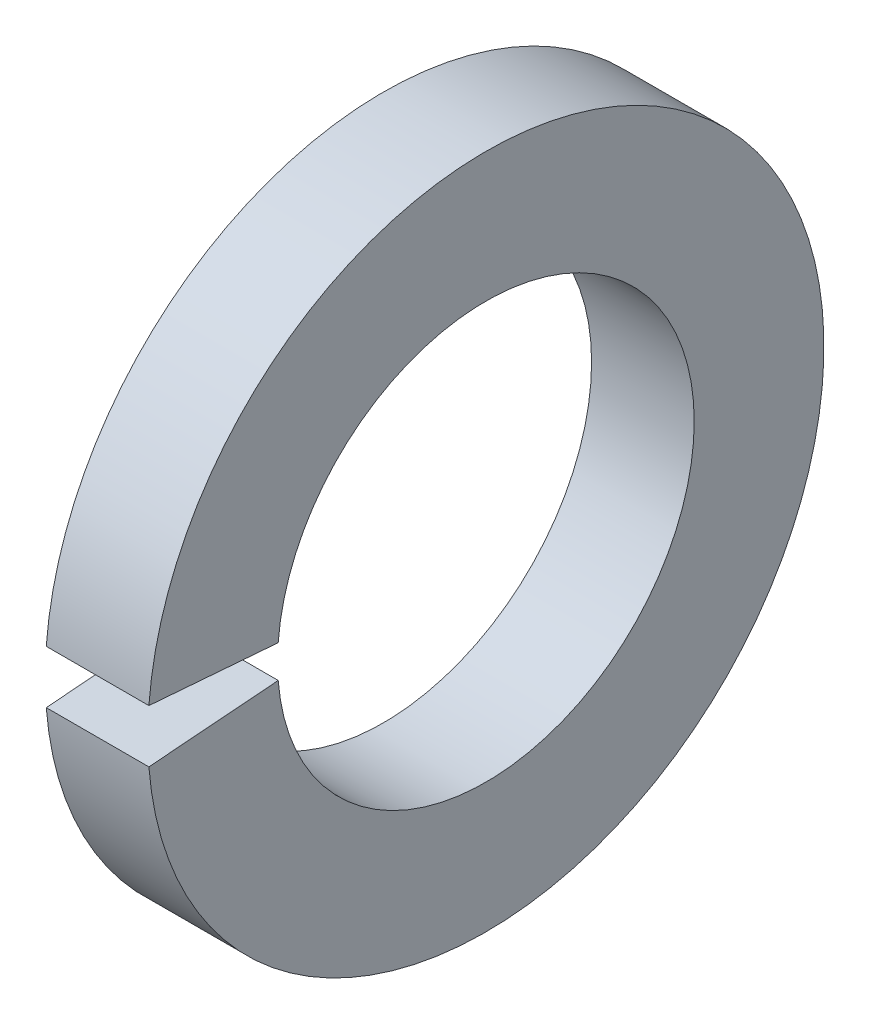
ISO-10303-21;
HEADER;
FILE_DESCRIPTION(('STEP AP214'),'2;1');
FILE_NAME('part.step','',(''),(''),'','','');
FILE_SCHEMA(('AUTOMOTIVE_DESIGN { 1 0 10303 214 1 1 1 1 }'));
ENDSEC;
DATA;
#1=APPLICATION_CONTEXT('core data for automotive mechanical design processes');
#2=APPLICATION_PROTOCOL_DEFINITION('international standard','automotive_design',2000,#1);
#3=PRODUCT_CONTEXT('',#1,'mechanical');
#4=PRODUCT('Part','Part','',(#3));
#5=PRODUCT_RELATED_PRODUCT_CATEGORY('part','',(#4));
#6=PRODUCT_DEFINITION_FORMATION('','',#4);
#7=PRODUCT_DEFINITION_CONTEXT('part definition',#1,'design');
#8=PRODUCT_DEFINITION('design','',#6,#7);
#9=PRODUCT_DEFINITION_SHAPE('','',#8);
#10=(LENGTH_UNIT() NAMED_UNIT(*) SI_UNIT(.MILLI.,.METRE.));
#11=(NAMED_UNIT(*) PLANE_ANGLE_UNIT() SI_UNIT($,.RADIAN.));
#12=(NAMED_UNIT(*) SI_UNIT($,.STERADIAN.) SOLID_ANGLE_UNIT());
#13=UNCERTAINTY_MEASURE_WITH_UNIT(LENGTH_MEASURE(1.E-05),#10,'distance_accuracy_value','');
#14=(GEOMETRIC_REPRESENTATION_CONTEXT(3) GLOBAL_UNCERTAINTY_ASSIGNED_CONTEXT((#13)) GLOBAL_UNIT_ASSIGNED_CONTEXT((#10,
#11,#12)) REPRESENTATION_CONTEXT('',''));
#15=CARTESIAN_POINT('',(0.,0.,0.));
#16=DIRECTION('',(0.,0.,1.));
#17=DIRECTION('',(1.,0.,0.));
#18=AXIS2_PLACEMENT_3D('',#15,#16,#17);
#19=CARTESIAN_POINT('',(-34.9249999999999,0.,0.));
#20=DIRECTION('',(-1.,0.,0.));
#21=DIRECTION('',(0.,0.,1.));
#22=AXIS2_PLACEMENT_3D('',#19,#20,#21);
#23=CYLINDRICAL_SURFACE('',#22,12.8905);
#24=CARTESIAN_POINT('',(0.,0.,0.));
#25=DIRECTION('',(-1.,0.,0.));
#26=DIRECTION('',(0.,0.,1.));
#27=AXIS2_PLACEMENT_3D('',#24,#25,#26);
#28=CIRCLE('',#27,12.8905);
#29=CARTESIAN_POINT('',(0.,1.01137697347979,12.8507628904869));
#30=VERTEX_POINT('',#29);
#31=CARTESIAN_POINT('',(0.,-1.01137697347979,12.8507628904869));
#32=VERTEX_POINT('',#31);
#33=EDGE_CURVE('E84',#30,#32,#28,.T.);
#34=ORIENTED_EDGE('',*,*,#33,.F.);
#35=DIRECTION('',(-1.,0.,0.));
#36=VECTOR('',#35,1.);
#37=CARTESIAN_POINT('',(-34.9249999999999,1.01137697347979,12.8507628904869));
#38=LINE('',#37,#36);
#39=CARTESIAN_POINT('',(-6.35,1.01137697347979,12.8507628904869));
#40=VERTEX_POINT('',#39);
#41=EDGE_CURVE('E98',#30,#40,#38,.T.);
#42=ORIENTED_EDGE('',*,*,#41,.T.);
#43=CARTESIAN_POINT('',(-6.35,0.,0.));
#44=DIRECTION('',(-1.,0.,0.));
#45=DIRECTION('',(0.,0.,1.));
#46=AXIS2_PLACEMENT_3D('',#43,#44,#45);
#47=CIRCLE('',#46,12.8905);
#48=CARTESIAN_POINT('',(-6.35,-1.01137697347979,12.8507628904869));
#49=VERTEX_POINT('',#48);
#50=EDGE_CURVE('E86',#40,#49,#47,.T.);
#51=ORIENTED_EDGE('',*,*,#50,.T.);
#52=DIRECTION('',(-1.,0.,0.));
#53=VECTOR('',#52,1.);
#54=CARTESIAN_POINT('',(-34.9249999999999,-1.01137697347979,12.8507628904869));
#55=LINE('',#54,#53);
#56=EDGE_CURVE('E54',#32,#49,#55,.T.);
#57=ORIENTED_EDGE('',*,*,#56,.F.);
#58=EDGE_LOOP('',(#34,#42,#51,#57));
#59=FACE_BOUND('',#58,.T.);
#60=ADVANCED_FACE('F33',(#59),#23,.F.);
#61=CARTESIAN_POINT('',(0.,12.8905,0.));
#62=DIRECTION('',(-1.,0.,0.));
#63=DIRECTION('',(0.,0.,1.));
#64=AXIS2_PLACEMENT_3D('',#61,#62,#63);
#65=PLANE('',#64);
#66=CARTESIAN_POINT('',(0.,0.,0.));
#67=DIRECTION('',(-1.,0.,0.));
#68=DIRECTION('',(0.,0.,1.));
#69=AXIS2_PLACEMENT_3D('',#66,#67,#68);
#70=CIRCLE('',#69,20.9169);
#71=CARTESIAN_POINT('',(0.,1.64112105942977,20.8524201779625));
#72=VERTEX_POINT('',#71);
#73=CARTESIAN_POINT('',(0.,-1.64112105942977,20.8524201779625));
#74=VERTEX_POINT('',#73);
#75=EDGE_CURVE('E90',#72,#74,#70,.T.);
#76=ORIENTED_EDGE('',*,*,#75,.F.);
#77=DIRECTION('',(0.,0.0784590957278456,0.996917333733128));
#78=VECTOR('',#77,1.);
#79=CARTESIAN_POINT('',(0.,0.,0.));
#80=LINE('',#79,#78);
#81=EDGE_CURVE('E78',#30,#72,#80,.T.);
#82=ORIENTED_EDGE('',*,*,#81,.F.);
#83=ORIENTED_EDGE('',*,*,#33,.T.);
#84=DIRECTION('',(0.,-0.0784590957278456,0.996917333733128));
#85=VECTOR('',#84,1.);
#86=CARTESIAN_POINT('',(0.,0.,0.));
#87=LINE('',#86,#85);
#88=EDGE_CURVE('E70',#32,#74,#87,.T.);
#89=ORIENTED_EDGE('',*,*,#88,.T.);
#90=EDGE_LOOP('',(#76,#82,#83,#89));
#91=FACE_BOUND('',#90,.T.);
#92=ADVANCED_FACE('F89',(#91),#65,.F.);
#93=CARTESIAN_POINT('',(-34.9249999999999,0.,0.));
#94=DIRECTION('',(-1.,0.,0.));
#95=DIRECTION('',(0.,0.,1.));
#96=AXIS2_PLACEMENT_3D('',#93,#94,#95);
#97=CYLINDRICAL_SURFACE('',#96,20.9169);
#98=CARTESIAN_POINT('',(-6.35,0.,0.));
#99=DIRECTION('',(-1.,0.,0.));
#100=DIRECTION('',(0.,0.,1.));
#101=AXIS2_PLACEMENT_3D('',#98,#99,#100);
#102=CIRCLE('',#101,20.9169);
#103=CARTESIAN_POINT('',(-6.35,1.64112105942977,20.8524201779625));
#104=VERTEX_POINT('',#103);
#105=CARTESIAN_POINT('',(-6.35,-1.64112105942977,20.8524201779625));
#106=VERTEX_POINT('',#105);
#107=EDGE_CURVE('E92',#104,#106,#102,.T.);
#108=ORIENTED_EDGE('',*,*,#107,.F.);
#109=DIRECTION('',(-1.,0.,0.));
#110=VECTOR('',#109,1.);
#111=CARTESIAN_POINT('',(-34.9249999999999,1.64112105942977,20.8524201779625));
#112=LINE('',#111,#110);
#113=EDGE_CURVE('E47',#104,#72,#112,.F.);
#114=ORIENTED_EDGE('',*,*,#113,.T.);
#115=ORIENTED_EDGE('',*,*,#75,.T.);
#116=DIRECTION('',(-1.,0.,0.));
#117=VECTOR('',#116,1.);
#118=CARTESIAN_POINT('',(-34.9249999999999,-1.64112105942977,20.8524201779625));
#119=LINE('',#118,#117);
#120=EDGE_CURVE('E73',#106,#74,#119,.F.);
#121=ORIENTED_EDGE('',*,*,#120,.F.);
#122=EDGE_LOOP('',(#108,#114,#115,#121));
#123=FACE_BOUND('',#122,.T.);
#124=ADVANCED_FACE('F105',(#123),#97,.T.);
#125=CARTESIAN_POINT('',(-6.35,20.9169,0.));
#126=DIRECTION('',(1.,0.,0.));
#127=DIRECTION('',(0.,0.,-1.));
#128=AXIS2_PLACEMENT_3D('',#125,#126,#127);
#129=PLANE('',#128);
#130=ORIENTED_EDGE('',*,*,#50,.F.);
#131=DIRECTION('',(0.,0.0784590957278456,0.996917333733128));
#132=VECTOR('',#131,1.);
#133=CARTESIAN_POINT('',(-6.35,0.128760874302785,1.63606203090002));
#134=LINE('',#133,#132);
#135=EDGE_CURVE('E11',#40,#104,#134,.T.);
#136=ORIENTED_EDGE('',*,*,#135,.T.);
#137=ORIENTED_EDGE('',*,*,#107,.T.);
#138=DIRECTION('',(0.,-0.0784590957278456,0.996917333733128));
#139=VECTOR('',#138,1.);
#140=CARTESIAN_POINT('',(-6.35,0.128760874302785,-1.63606203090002));
#141=LINE('',#140,#139);
#142=EDGE_CURVE('E40',#49,#106,#141,.T.);
#143=ORIENTED_EDGE('',*,*,#142,.F.);
#144=EDGE_LOOP('',(#130,#136,#137,#143));
#145=FACE_BOUND('',#144,.T.);
#146=ADVANCED_FACE('F107',(#145),#129,.F.);
#147=CARTESIAN_POINT('',(-6.35,0.,0.));
#148=DIRECTION('',(0.,0.996917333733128,0.0784590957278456));
#149=DIRECTION('',(0.,-0.0784590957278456,0.996917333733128));
#150=AXIS2_PLACEMENT_3D('',#147,#148,#149);
#151=PLANE('',#150);
#152=ORIENTED_EDGE('',*,*,#56,.T.);
#153=ORIENTED_EDGE('',*,*,#142,.T.);
#154=ORIENTED_EDGE('',*,*,#120,.T.);
#155=ORIENTED_EDGE('',*,*,#88,.F.);
#156=EDGE_LOOP('',(#152,#153,#154,#155));
#157=FACE_BOUND('',#156,.T.);
#158=ADVANCED_FACE('F71',(#157),#151,.T.);
#159=CARTESIAN_POINT('',(-6.35,0.,0.));
#160=DIRECTION('',(0.,0.996917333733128,-0.0784590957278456));
#161=DIRECTION('',(0.,0.0784590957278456,0.996917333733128));
#162=AXIS2_PLACEMENT_3D('',#159,#160,#161);
#163=PLANE('',#162);
#164=ORIENTED_EDGE('',*,*,#81,.T.);
#165=ORIENTED_EDGE('',*,*,#113,.F.);
#166=ORIENTED_EDGE('',*,*,#135,.F.);
#167=ORIENTED_EDGE('',*,*,#41,.F.);
#168=EDGE_LOOP('',(#164,#165,#166,#167));
#169=FACE_BOUND('',#168,.T.);
#170=ADVANCED_FACE('F102',(#169),#163,.F.);
#171=CLOSED_SHELL('',(#60,#92,#124,#146,#158,#170));
#172=MANIFOLD_SOLID_BREP('B2',#171);
#173=ADVANCED_BREP_SHAPE_REPRESENTATION('',(#18,#172),#14);
#174=SHAPE_DEFINITION_REPRESENTATION(#9,#173);
ENDSEC;
END-ISO-10303-21;
